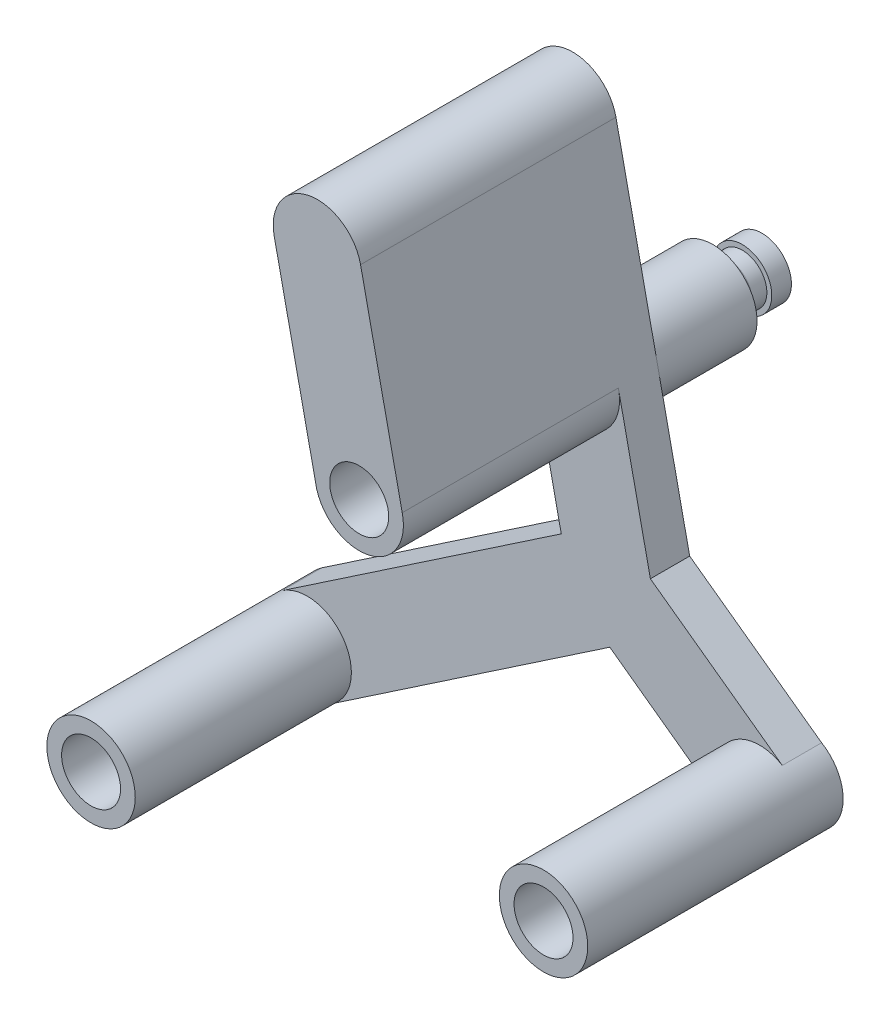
ISO-10303-21;
HEADER;
FILE_DESCRIPTION(('STEP AP214'),'2;1');
FILE_NAME('part.step','',(''),(''),'','','');
FILE_SCHEMA(('AUTOMOTIVE_DESIGN { 1 0 10303 214 1 1 1 1 }'));
ENDSEC;
DATA;
#1=APPLICATION_CONTEXT('core data for automotive mechanical design processes');
#2=APPLICATION_PROTOCOL_DEFINITION('international standard','automotive_design',2000,#1);
#3=PRODUCT_CONTEXT('',#1,'mechanical');
#4=PRODUCT('Part','Part','',(#3));
#5=PRODUCT_RELATED_PRODUCT_CATEGORY('part','',(#4));
#6=PRODUCT_DEFINITION_FORMATION('','',#4);
#7=PRODUCT_DEFINITION_CONTEXT('part definition',#1,'design');
#8=PRODUCT_DEFINITION('design','',#6,#7);
#9=PRODUCT_DEFINITION_SHAPE('','',#8);
#10=(LENGTH_UNIT() NAMED_UNIT(*) SI_UNIT(.MILLI.,.METRE.));
#11=(NAMED_UNIT(*) PLANE_ANGLE_UNIT() SI_UNIT($,.RADIAN.));
#12=(NAMED_UNIT(*) SI_UNIT($,.STERADIAN.) SOLID_ANGLE_UNIT());
#13=UNCERTAINTY_MEASURE_WITH_UNIT(LENGTH_MEASURE(1.E-05),#10,'distance_accuracy_value','');
#14=(GEOMETRIC_REPRESENTATION_CONTEXT(3) GLOBAL_UNCERTAINTY_ASSIGNED_CONTEXT((#13)) GLOBAL_UNIT_ASSIGNED_CONTEXT((#10,
#11,#12)) REPRESENTATION_CONTEXT('',''));
#15=CARTESIAN_POINT('',(0.,0.,0.));
#16=DIRECTION('',(0.,0.,1.));
#17=DIRECTION('',(1.,0.,0.));
#18=AXIS2_PLACEMENT_3D('',#15,#16,#17);
#19=CARTESIAN_POINT('',(0.,0.,-4.));
#20=DIRECTION('',(0.,0.,1.));
#21=DIRECTION('',(1.,0.,0.));
#22=AXIS2_PLACEMENT_3D('',#19,#20,#21);
#23=PLANE('',#22);
#24=DIRECTION('',(0.209958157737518,-0.977710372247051,0.));
#25=VECTOR('',#24,1.);
#26=CARTESIAN_POINT('',(4.39865793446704,0.944588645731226,-4.));
#27=LINE('',#26,#25);
#28=CARTESIAN_POINT('',(-3.46138157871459,37.5463679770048,-4.));
#29=VERTEX_POINT('',#28);
#30=CARTESIAN_POINT('',(0.80017246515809,17.7016254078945,-4.));
#31=VERTEX_POINT('',#30);
#32=EDGE_CURVE('E318',#29,#31,#27,.T.);
#33=ORIENTED_EDGE('',*,*,#32,.T.);
#34=CARTESIAN_POINT('',(-3.59848546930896,16.7570367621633,-4.));
#35=DIRECTION('',(0.,0.,-1.));
#36=DIRECTION('',(-1.,0.,0.));
#37=AXIS2_PLACEMENT_3D('',#34,#35,#36);
#38=CIRCLE('',#37,4.49893757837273);
#39=CARTESIAN_POINT('',(-8.04749548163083,16.0886437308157,-4.));
#40=VERTEX_POINT('',#39);
#41=EDGE_CURVE('E48',#40,#31,#38,.T.);
#42=ORIENTED_EDGE('',*,*,#41,.F.);
#43=DIRECTION('',(-0.209958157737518,0.977710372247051,0.));
#44=VECTOR('',#43,1.);
#45=CARTESIAN_POINT('',(-4.39009341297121,-0.942749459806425,-4.));
#46=LINE('',#45,#44);
#47=CARTESIAN_POINT('',(-12.2501329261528,35.6590298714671,-4.));
#48=VERTEX_POINT('',#47);
#49=EDGE_CURVE('E324',#40,#48,#46,.T.);
#50=ORIENTED_EDGE('',*,*,#49,.T.);
#51=CARTESIAN_POINT('',(-7.85575725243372,36.6026989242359,-4.));
#52=DIRECTION('',(0.,0.,-1.));
#53=DIRECTION('',(1.,0.,0.));
#54=AXIS2_PLACEMENT_3D('',#51,#52,#53);
#55=CIRCLE('',#54,4.49455769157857);
#56=EDGE_CURVE('E154',#48,#29,#55,.T.);
#57=ORIENTED_EDGE('',*,*,#56,.T.);
#58=EDGE_LOOP('',(#33,#42,#50,#57));
#59=FACE_BOUND('',#58,.T.);
#60=ADVANCED_FACE('F33',(#59),#23,.F.);
#61=CARTESIAN_POINT('',(0.,0.,0.));
#62=DIRECTION('',(0.,0.,1.));
#63=DIRECTION('',(1.,0.,0.));
#64=AXIS2_PLACEMENT_3D('',#61,#62,#63);
#65=PLANE('',#64);
#66=DIRECTION('',(0.809551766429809,-0.587048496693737,0.));
#67=VECTOR('',#66,1.);
#68=CARTESIAN_POINT('',(-2.64171823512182,-3.64298294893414,0.));
#69=LINE('',#68,#67);
#70=CARTESIAN_POINT('',(-0.0904885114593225,-5.49301359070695,0.));
#71=VERTEX_POINT('',#70);
#72=CARTESIAN_POINT('',(12.521976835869,-14.6389745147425,0.));
#73=VERTEX_POINT('',#72);
#74=EDGE_CURVE('E236',#71,#73,#69,.T.);
#75=ORIENTED_EDGE('',*,*,#74,.T.);
#76=CARTESIAN_POINT('',(15.1636950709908,-10.9959915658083,0.));
#77=DIRECTION('',(0.,0.,1.));
#78=DIRECTION('',(1.,0.,0.));
#79=AXIS2_PLACEMENT_3D('',#76,#77,#78);
#80=CIRCLE('',#79,4.5);
#81=CARTESIAN_POINT('',(17.4737197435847,-7.13415443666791,0.));
#82=VERTEX_POINT('',#81);
#83=EDGE_CURVE('E182',#82,#73,#80,.T.);
#84=ORIENTED_EDGE('',*,*,#83,.F.);
#85=DIRECTION('',(0.809551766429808,-0.587048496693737,0.));
#86=VECTOR('',#85,1.);
#87=CARTESIAN_POINT('',(2.63141763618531,3.62877821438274,0.));
#88=LINE('',#87,#86);
#89=CARTESIAN_POINT('',(4.04188395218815,2.60597502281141,0.));
#90=VERTEX_POINT('',#89);
#91=EDGE_CURVE('E352',#90,#82,#88,.T.);
#92=ORIENTED_EDGE('',*,*,#91,.F.);
#93=DIRECTION('',(0.209958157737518,-0.977710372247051,0.));
#94=VECTOR('',#93,1.);
#95=CARTESIAN_POINT('',(4.39865793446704,0.944588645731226,0.));
#96=LINE('',#95,#94);
#97=CARTESIAN_POINT('',(0.820701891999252,17.6060262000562,0.));
#98=VERTEX_POINT('',#97);
#99=EDGE_CURVE('E248',#98,#90,#96,.T.);
#100=ORIENTED_EDGE('',*,*,#99,.F.);
#101=CARTESIAN_POINT('',(-3.59848546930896,16.7570367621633,0.));
#102=DIRECTION('',(0.,0.,1.));
#103=DIRECTION('',(1.,0.,0.));
#104=AXIS2_PLACEMENT_3D('',#101,#102,#103);
#105=CIRCLE('',#104,4.5);
#106=CARTESIAN_POINT('',(-7.92618799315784,15.5237521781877,0.));
#107=VERTEX_POINT('',#106);
#108=EDGE_CURVE('E347',#107,#98,#105,.T.);
#109=ORIENTED_EDGE('',*,*,#108,.F.);
#110=DIRECTION('',(-0.209958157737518,0.977710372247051,0.));
#111=VECTOR('',#110,1.);
#112=CARTESIAN_POINT('',(-4.39009341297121,-0.942749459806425,0.));
#113=LINE('',#112,#111);
#114=CARTESIAN_POINT('',(-5.02892290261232,2.03208240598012,0.));
#115=VERTEX_POINT('',#114);
#116=EDGE_CURVE('E349',#115,#107,#113,.T.);
#117=ORIENTED_EDGE('',*,*,#116,.F.);
#118=DIRECTION('',(0.828448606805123,0.560065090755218,0.));
#119=VECTOR('',#118,1.);
#120=CARTESIAN_POINT('',(-2.52029290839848,3.72801873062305,0.));
#121=LINE('',#120,#119);
#122=CARTESIAN_POINT('',(-33.4165334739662,-17.1591016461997,0.));
#123=VERTEX_POINT('',#122);
#124=EDGE_CURVE('E216',#123,#115,#121,.T.);
#125=ORIENTED_EDGE('',*,*,#124,.F.);
#126=CARTESIAN_POINT('',(-30.8962405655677,-20.8871203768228,0.));
#127=DIRECTION('',(0.,0.,1.));
#128=DIRECTION('',(1.,0.,0.));
#129=AXIS2_PLACEMENT_3D('',#126,#127,#128);
#130=CIRCLE('',#129,4.5);
#131=CARTESIAN_POINT('',(-28.3759476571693,-24.6151391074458,0.));
#132=VERTEX_POINT('',#131);
#133=EDGE_CURVE('E203',#132,#123,#130,.T.);
#134=ORIENTED_EDGE('',*,*,#133,.F.);
#135=DIRECTION('',(0.828448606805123,0.560065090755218,0.));
#136=VECTOR('',#135,1.);
#137=CARTESIAN_POINT('',(2.52029290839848,-3.72801873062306,0.));
#138=LINE('',#137,#136);
#139=EDGE_CURVE('E219',#132,#71,#138,.T.);
#140=ORIENTED_EDGE('',*,*,#139,.T.);
#141=EDGE_LOOP('',(#75,#84,#92,#100,#109,#117,#125,#134,#140));
#142=FACE_BOUND('',#141,.T.);
#143=ADVANCED_FACE('F289',(#142),#65,.T.);
#144=CARTESIAN_POINT('',(-30.8962405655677,-20.8871203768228,22.));
#145=DIRECTION('',(0.,0.,-1.));
#146=DIRECTION('',(-1.,0.,0.));
#147=AXIS2_PLACEMENT_3D('',#144,#145,#146);
#148=CYLINDRICAL_SURFACE('',#147,4.5);
#149=CARTESIAN_POINT('',(-30.8962405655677,-20.8871203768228,22.));
#150=DIRECTION('',(0.,0.,1.));
#151=DIRECTION('',(1.,0.,0.));
#152=AXIS2_PLACEMENT_3D('',#149,#150,#151);
#153=CIRCLE('',#152,4.5);
#154=CARTESIAN_POINT('',(-26.3962405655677,-20.8871203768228,22.));
#155=VERTEX_POINT('',#154);
#156=EDGE_CURVE('E199',#155,#155,#153,.T.);
#157=ORIENTED_EDGE('',*,*,#156,.F.);
#158=EDGE_LOOP('',(#157));
#159=FACE_BOUND('',#158,.T.);
#160=ORIENTED_EDGE('',*,*,#133,.T.);
#161=DIRECTION('',(0.,0.,1.));
#162=VECTOR('',#161,1.);
#163=CARTESIAN_POINT('',(-33.4165334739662,-17.1591016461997,-4.));
#164=LINE('',#163,#162);
#165=CARTESIAN_POINT('',(-33.4165334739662,-17.1591016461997,-4.));
#166=VERTEX_POINT('',#165);
#167=EDGE_CURVE('E223',#166,#123,#164,.T.);
#168=ORIENTED_EDGE('',*,*,#167,.F.);
#169=CARTESIAN_POINT('',(-30.8962405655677,-20.8871203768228,-4.));
#170=DIRECTION('',(0.,0.,1.));
#171=DIRECTION('',(1.,0.,0.));
#172=AXIS2_PLACEMENT_3D('',#169,#170,#171);
#173=CIRCLE('',#172,4.5);
#174=CARTESIAN_POINT('',(-28.3759476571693,-24.6151391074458,-4.));
#175=VERTEX_POINT('',#174);
#176=EDGE_CURVE('E374',#166,#175,#173,.T.);
#177=ORIENTED_EDGE('',*,*,#176,.T.);
#178=DIRECTION('',(0.,0.,1.));
#179=VECTOR('',#178,1.);
#180=CARTESIAN_POINT('',(-28.3759476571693,-24.6151391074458,-4.));
#181=LINE('',#180,#179);
#182=EDGE_CURVE('E226',#175,#132,#181,.T.);
#183=ORIENTED_EDGE('',*,*,#182,.T.);
#184=EDGE_LOOP('',(#160,#168,#177,#183));
#185=FACE_BOUND('',#184,.T.);
#186=ADVANCED_FACE('F286',(#159,#185),#148,.T.);
#187=CARTESIAN_POINT('',(-30.8962405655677,-20.8871203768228,22.));
#188=DIRECTION('',(0.,0.,1.));
#189=DIRECTION('',(1.,0.,0.));
#190=AXIS2_PLACEMENT_3D('',#187,#188,#189);
#191=PLANE('',#190);
#192=CARTESIAN_POINT('',(-30.8962405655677,-20.8871203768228,22.));
#193=DIRECTION('',(0.,0.,1.));
#194=DIRECTION('',(1.,0.,0.));
#195=AXIS2_PLACEMENT_3D('',#192,#193,#194);
#196=CIRCLE('',#195,3.);
#197=CARTESIAN_POINT('',(-27.8962405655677,-20.8871203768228,22.));
#198=VERTEX_POINT('',#197);
#199=EDGE_CURVE('E429',#198,#198,#196,.T.);
#200=ORIENTED_EDGE('',*,*,#199,.F.);
#201=EDGE_LOOP('',(#200));
#202=FACE_BOUND('',#201,.T.);
#203=ORIENTED_EDGE('',*,*,#156,.T.);
#204=EDGE_LOOP('',(#203));
#205=FACE_BOUND('',#204,.T.);
#206=ADVANCED_FACE('F283',(#202,#205),#191,.T.);
#207=CARTESIAN_POINT('',(-2.52029290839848,3.72801873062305,-4.));
#208=DIRECTION('',(0.560065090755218,-0.828448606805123,0.));
#209=DIRECTION('',(0.828448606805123,0.560065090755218,0.));
#210=AXIS2_PLACEMENT_3D('',#207,#208,#209);
#211=PLANE('',#210);
#212=ORIENTED_EDGE('',*,*,#124,.T.);
#213=DIRECTION('',(0.,0.,1.));
#214=VECTOR('',#213,1.);
#215=CARTESIAN_POINT('',(-5.02892290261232,2.03208240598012,-4.));
#216=LINE('',#215,#214);
#217=CARTESIAN_POINT('',(-5.02892290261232,2.03208240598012,-4.));
#218=VERTEX_POINT('',#217);
#219=EDGE_CURVE('E208',#218,#115,#216,.T.);
#220=ORIENTED_EDGE('',*,*,#219,.F.);
#221=DIRECTION('',(0.828448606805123,0.560065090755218,0.));
#222=VECTOR('',#221,1.);
#223=CARTESIAN_POINT('',(-2.52029290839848,3.72801873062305,-4.));
#224=LINE('',#223,#222);
#225=EDGE_CURVE('E350',#166,#218,#224,.T.);
#226=ORIENTED_EDGE('',*,*,#225,.F.);
#227=ORIENTED_EDGE('',*,*,#167,.T.);
#228=EDGE_LOOP('',(#212,#220,#226,#227));
#229=FACE_BOUND('',#228,.T.);
#230=ADVANCED_FACE('F280',(#229),#211,.F.);
#231=CARTESIAN_POINT('',(-4.39009341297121,-0.942749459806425,-4.));
#232=DIRECTION('',(0.977710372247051,0.209958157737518,0.));
#233=DIRECTION('',(-0.209958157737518,0.977710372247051,0.));
#234=AXIS2_PLACEMENT_3D('',#231,#232,#233);
#235=PLANE('',#234);
#236=ORIENTED_EDGE('',*,*,#116,.T.);
#237=DIRECTION('',(0.209958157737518,-0.977710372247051,0.));
#238=VECTOR('',#237,1.);
#239=CARTESIAN_POINT('',(-4.39009341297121,-0.942749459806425,0.));
#240=LINE('',#239,#238);
#241=CARTESIAN_POINT('',(-8.05096977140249,16.1048224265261,0.));
#242=VERTEX_POINT('',#241);
#243=EDGE_CURVE('E220',#242,#107,#240,.T.);
#244=ORIENTED_EDGE('',*,*,#243,.F.);
#245=DIRECTION('',(0.,0.,-1.));
#246=VECTOR('',#245,1.);
#247=CARTESIAN_POINT('',(-8.05096977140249,16.1048224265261,50.2314994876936));
#248=LINE('',#247,#246);
#249=CARTESIAN_POINT('',(-8.05096977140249,16.1048224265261,22.));
#250=VERTEX_POINT('',#249);
#251=EDGE_CURVE('E160',#250,#242,#248,.T.);
#252=ORIENTED_EDGE('',*,*,#251,.F.);
#253=DIRECTION('',(-0.209958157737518,0.977710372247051,0.));
#254=VECTOR('',#253,1.);
#255=CARTESIAN_POINT('',(-8.05096977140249,16.1048224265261,22.));
#256=LINE('',#255,#254);
#257=CARTESIAN_POINT('',(-12.2501329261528,35.6590298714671,22.));
#258=VERTEX_POINT('',#257);
#259=EDGE_CURVE('E141',#250,#258,#256,.T.);
#260=ORIENTED_EDGE('',*,*,#259,.T.);
#261=DIRECTION('',(0.,0.,-1.));
#262=VECTOR('',#261,1.);
#263=CARTESIAN_POINT('',(-12.2501329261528,35.6590298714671,50.2314994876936));
#264=LINE('',#263,#262);
#265=EDGE_CURVE('E148',#258,#48,#264,.T.);
#266=ORIENTED_EDGE('',*,*,#265,.T.);
#267=ORIENTED_EDGE('',*,*,#49,.F.);
#268=DIRECTION('',(0.,0.,1.));
#269=VECTOR('',#268,1.);
#270=CARTESIAN_POINT('',(-8.04749548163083,16.0886437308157,-14.));
#271=LINE('',#270,#269);
#272=CARTESIAN_POINT('',(-8.04749548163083,16.0886437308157,-14.));
#273=VERTEX_POINT('',#272);
#274=EDGE_CURVE('E179',#273,#40,#271,.T.);
#275=ORIENTED_EDGE('',*,*,#274,.F.);
#276=DIRECTION('',(-0.209958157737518,0.977710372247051,0.));
#277=VECTOR('',#276,1.);
#278=CARTESIAN_POINT('',(-4.39009341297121,-0.942749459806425,-14.));
#279=LINE('',#278,#277);
#280=CARTESIAN_POINT('',(-7.92966228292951,15.539930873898,-14.));
#281=VERTEX_POINT('',#280);
#282=EDGE_CURVE('E177',#281,#273,#279,.T.);
#283=ORIENTED_EDGE('',*,*,#282,.F.);
#284=DIRECTION('',(0.,0.,1.));
#285=VECTOR('',#284,1.);
#286=CARTESIAN_POINT('',(-7.92966228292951,15.539930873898,-14.));
#287=LINE('',#286,#285);
#288=CARTESIAN_POINT('',(-7.92966228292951,15.539930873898,-4.));
#289=VERTEX_POINT('',#288);
#290=EDGE_CURVE('E194',#281,#289,#287,.T.);
#291=ORIENTED_EDGE('',*,*,#290,.T.);
#292=EDGE_CURVE('E227',#218,#289,#46,.T.);
#293=ORIENTED_EDGE('',*,*,#292,.F.);
#294=ORIENTED_EDGE('',*,*,#219,.T.);
#295=EDGE_LOOP('',(#236,#244,#252,#260,#266,#267,#275,#283,#291,#293,#294));
#296=FACE_BOUND('',#295,.T.);
#297=ADVANCED_FACE('F158',(#296),#235,.F.);
#298=CARTESIAN_POINT('',(-3.59848546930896,16.7570367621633,-4.));
#299=DIRECTION('',(0.,0.,1.));
#300=DIRECTION('',(1.,0.,0.));
#301=AXIS2_PLACEMENT_3D('',#298,#299,#300);
#302=CYLINDRICAL_SURFACE('',#301,4.5);
#303=DIRECTION('',(0.,0.,-1.));
#304=VECTOR('',#303,1.);
#305=CARTESIAN_POINT('',(0.779643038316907,17.7972246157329,50.2314994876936));
#306=LINE('',#305,#304);
#307=CARTESIAN_POINT('',(0.779643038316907,17.7972246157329,22.));
#308=VERTEX_POINT('',#307);
#309=CARTESIAN_POINT('',(0.779643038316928,17.7972246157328,0.));
#310=VERTEX_POINT('',#309);
#311=EDGE_CURVE('E167',#308,#310,#306,.T.);
#312=ORIENTED_EDGE('',*,*,#311,.F.);
#313=CARTESIAN_POINT('',(-3.59848546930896,16.7570367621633,22.));
#314=DIRECTION('',(0.,0.,1.));
#315=DIRECTION('',(1.,0.,0.));
#316=AXIS2_PLACEMENT_3D('',#313,#314,#315);
#317=CIRCLE('',#316,4.5);
#318=EDGE_CURVE('E384',#250,#308,#317,.T.);
#319=ORIENTED_EDGE('',*,*,#318,.F.);
#320=ORIENTED_EDGE('',*,*,#251,.T.);
#321=EDGE_CURVE('E391',#242,#107,#105,.T.);
#322=ORIENTED_EDGE('',*,*,#321,.T.);
#323=ORIENTED_EDGE('',*,*,#108,.T.);
#324=CARTESIAN_POINT('',(0.779643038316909,17.7972246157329,0.));
#325=DIRECTION('',(0.209958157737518,-0.977710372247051,0.));
#326=VECTOR('',#325,1.);
#327=LINE('',#324,#326);
#328=EDGE_CURVE('E243',#310,#98,#327,.T.);
#329=ORIENTED_EDGE('',*,*,#328,.F.);
#330=EDGE_LOOP('',(#312,#319,#320,#322,#323,#329));
#331=FACE_BOUND('',#330,.T.);
#332=ADVANCED_FACE('F261',(#331),#302,.T.);
#333=CARTESIAN_POINT('',(4.39865793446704,0.944588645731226,-4.));
#334=DIRECTION('',(-0.977710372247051,-0.209958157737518,0.));
#335=DIRECTION('',(0.209958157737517,-0.977710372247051,0.));
#336=AXIS2_PLACEMENT_3D('',#333,#334,#335);
#337=PLANE('',#336);
#338=ORIENTED_EDGE('',*,*,#328,.T.);
#339=ORIENTED_EDGE('',*,*,#99,.T.);
#340=DIRECTION('',(0.,0.,1.));
#341=VECTOR('',#340,1.);
#342=CARTESIAN_POINT('',(4.04188395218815,2.60597502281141,-4.));
#343=LINE('',#342,#341);
#344=CARTESIAN_POINT('',(4.04188395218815,2.60597502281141,-4.));
#345=VERTEX_POINT('',#344);
#346=EDGE_CURVE('E320',#345,#90,#343,.T.);
#347=ORIENTED_EDGE('',*,*,#346,.F.);
#348=EDGE_CURVE('E315',#31,#345,#27,.T.);
#349=ORIENTED_EDGE('',*,*,#348,.F.);
#350=ORIENTED_EDGE('',*,*,#32,.F.);
#351=DIRECTION('',(0.,0.,-1.));
#352=VECTOR('',#351,1.);
#353=CARTESIAN_POINT('',(-3.46138157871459,37.5463679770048,50.2314994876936));
#354=LINE('',#353,#352);
#355=CARTESIAN_POINT('',(-3.46138157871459,37.5463679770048,22.));
#356=VERTEX_POINT('',#355);
#357=EDGE_CURVE('E147',#356,#29,#354,.T.);
#358=ORIENTED_EDGE('',*,*,#357,.F.);
#359=DIRECTION('',(0.209958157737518,-0.977710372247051,0.));
#360=VECTOR('',#359,1.);
#361=CARTESIAN_POINT('',(-3.46138157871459,37.5463679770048,22.));
#362=LINE('',#361,#360);
#363=EDGE_CURVE('E143',#356,#308,#362,.T.);
#364=ORIENTED_EDGE('',*,*,#363,.T.);
#365=ORIENTED_EDGE('',*,*,#311,.T.);
#366=EDGE_LOOP('',(#338,#339,#347,#349,#350,#358,#364,#365));
#367=FACE_BOUND('',#366,.T.);
#368=ADVANCED_FACE('F250',(#367),#337,.F.);
#369=CARTESIAN_POINT('',(2.63141763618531,3.62877821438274,-4.));
#370=DIRECTION('',(-0.587048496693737,-0.809551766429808,0.));
#371=DIRECTION('',(0.809551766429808,-0.587048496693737,0.));
#372=AXIS2_PLACEMENT_3D('',#369,#370,#371);
#373=PLANE('',#372);
#374=ORIENTED_EDGE('',*,*,#91,.T.);
#375=DIRECTION('',(0.,0.,1.));
#376=VECTOR('',#375,1.);
#377=CARTESIAN_POINT('',(17.4737197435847,-7.13415443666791,-4.));
#378=LINE('',#377,#376);
#379=CARTESIAN_POINT('',(17.4737197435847,-7.13415443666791,-4.));
#380=VERTEX_POINT('',#379);
#381=EDGE_CURVE('E361',#380,#82,#378,.T.);
#382=ORIENTED_EDGE('',*,*,#381,.F.);
#383=DIRECTION('',(0.809551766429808,-0.587048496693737,0.));
#384=VECTOR('',#383,1.);
#385=CARTESIAN_POINT('',(2.63141763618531,3.62877821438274,-4.));
#386=LINE('',#385,#384);
#387=EDGE_CURVE('E322',#345,#380,#386,.T.);
#388=ORIENTED_EDGE('',*,*,#387,.F.);
#389=ORIENTED_EDGE('',*,*,#346,.T.);
#390=EDGE_LOOP('',(#374,#382,#388,#389));
#391=FACE_BOUND('',#390,.T.);
#392=ADVANCED_FACE('F260',(#391),#373,.F.);
#393=CARTESIAN_POINT('',(15.1636950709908,-10.9959915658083,-4.));
#394=DIRECTION('',(0.,0.,1.));
#395=DIRECTION('',(1.,0.,0.));
#396=AXIS2_PLACEMENT_3D('',#393,#394,#395);
#397=CYLINDRICAL_SURFACE('',#396,4.5);
#398=ORIENTED_EDGE('',*,*,#381,.T.);
#399=ORIENTED_EDGE('',*,*,#83,.T.);
#400=DIRECTION('',(0.,0.,1.));
#401=VECTOR('',#400,1.);
#402=CARTESIAN_POINT('',(12.521976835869,-14.6389745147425,-4.));
#403=LINE('',#402,#401);
#404=CARTESIAN_POINT('',(12.521976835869,-14.6389745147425,-4.));
#405=VERTEX_POINT('',#404);
#406=EDGE_CURVE('E362',#405,#73,#403,.T.);
#407=ORIENTED_EDGE('',*,*,#406,.F.);
#408=CARTESIAN_POINT('',(15.1636950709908,-10.9959915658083,-4.));
#409=DIRECTION('',(0.,0.,1.));
#410=DIRECTION('',(1.,0.,0.));
#411=AXIS2_PLACEMENT_3D('',#408,#409,#410);
#412=CIRCLE('',#411,4.5);
#413=EDGE_CURVE('E378',#405,#380,#412,.T.);
#414=ORIENTED_EDGE('',*,*,#413,.T.);
#415=EDGE_LOOP('',(#398,#399,#407,#414));
#416=FACE_BOUND('',#415,.T.);
#417=CARTESIAN_POINT('',(15.1636950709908,-10.9959915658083,22.));
#418=DIRECTION('',(0.,0.,1.));
#419=DIRECTION('',(1.,0.,0.));
#420=AXIS2_PLACEMENT_3D('',#417,#418,#419);
#421=CIRCLE('',#420,4.5);
#422=CARTESIAN_POINT('',(19.6636950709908,-10.9959915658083,22.));
#423=VERTEX_POINT('',#422);
#424=EDGE_CURVE('E385',#423,#423,#421,.T.);
#425=ORIENTED_EDGE('',*,*,#424,.F.);
#426=EDGE_LOOP('',(#425));
#427=FACE_BOUND('',#426,.T.);
#428=ADVANCED_FACE('F266',(#416,#427),#397,.T.);
#429=CARTESIAN_POINT('',(-2.64171823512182,-3.64298294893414,-4.));
#430=DIRECTION('',(-0.587048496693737,-0.809551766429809,0.));
#431=DIRECTION('',(0.809551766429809,-0.587048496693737,0.));
#432=AXIS2_PLACEMENT_3D('',#429,#430,#431);
#433=PLANE('',#432);
#434=ORIENTED_EDGE('',*,*,#74,.F.);
#435=DIRECTION('',(0.,0.,1.));
#436=VECTOR('',#435,1.);
#437=CARTESIAN_POINT('',(-0.0904885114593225,-5.49301359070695,-4.));
#438=LINE('',#437,#436);
#439=CARTESIAN_POINT('',(-0.0904885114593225,-5.49301359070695,-4.));
#440=VERTEX_POINT('',#439);
#441=EDGE_CURVE('E212',#440,#71,#438,.T.);
#442=ORIENTED_EDGE('',*,*,#441,.F.);
#443=DIRECTION('',(0.809551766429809,-0.587048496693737,0.));
#444=VECTOR('',#443,1.);
#445=CARTESIAN_POINT('',(-2.64171823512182,-3.64298294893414,-4.));
#446=LINE('',#445,#444);
#447=EDGE_CURVE('E376',#440,#405,#446,.T.);
#448=ORIENTED_EDGE('',*,*,#447,.T.);
#449=ORIENTED_EDGE('',*,*,#406,.T.);
#450=EDGE_LOOP('',(#434,#442,#448,#449));
#451=FACE_BOUND('',#450,.T.);
#452=ADVANCED_FACE('F270',(#451),#433,.T.);
#453=CARTESIAN_POINT('',(2.52029290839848,-3.72801873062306,-4.));
#454=DIRECTION('',(0.560065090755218,-0.828448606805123,0.));
#455=DIRECTION('',(0.828448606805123,0.560065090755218,0.));
#456=AXIS2_PLACEMENT_3D('',#453,#454,#455);
#457=PLANE('',#456);
#458=ORIENTED_EDGE('',*,*,#139,.F.);
#459=ORIENTED_EDGE('',*,*,#182,.F.);
#460=DIRECTION('',(0.828448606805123,0.560065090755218,0.));
#461=VECTOR('',#460,1.);
#462=CARTESIAN_POINT('',(2.52029290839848,-3.72801873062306,-4.));
#463=LINE('',#462,#461);
#464=EDGE_CURVE('E368',#175,#440,#463,.T.);
#465=ORIENTED_EDGE('',*,*,#464,.T.);
#466=ORIENTED_EDGE('',*,*,#441,.T.);
#467=EDGE_LOOP('',(#458,#459,#465,#466));
#468=FACE_BOUND('',#467,.T.);
#469=ADVANCED_FACE('F274',(#468),#457,.T.);
#470=EDGE_CURVE('E186',#31,#289,#38,.T.);
#471=ORIENTED_EDGE('',*,*,#470,.F.);
#472=ORIENTED_EDGE('',*,*,#348,.T.);
#473=ORIENTED_EDGE('',*,*,#387,.T.);
#474=ORIENTED_EDGE('',*,*,#413,.F.);
#475=ORIENTED_EDGE('',*,*,#447,.F.);
#476=ORIENTED_EDGE('',*,*,#464,.F.);
#477=ORIENTED_EDGE('',*,*,#176,.F.);
#478=ORIENTED_EDGE('',*,*,#225,.T.);
#479=ORIENTED_EDGE('',*,*,#292,.T.);
#480=EDGE_LOOP('',(#471,#472,#473,#474,#475,#476,#477,#478,#479));
#481=FACE_BOUND('',#480,.T.);
#482=ADVANCED_FACE('F278',(#481),#23,.F.);
#483=CARTESIAN_POINT('',(-3.59848546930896,16.7570367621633,0.));
#484=DIRECTION('',(0.,0.,1.));
#485=DIRECTION('',(1.,0.,0.));
#486=AXIS2_PLACEMENT_3D('',#483,#484,#485);
#487=PLANE('',#486);
#488=ORIENTED_EDGE('',*,*,#321,.F.);
#489=ORIENTED_EDGE('',*,*,#243,.T.);
#490=EDGE_LOOP('',(#488,#489));
#491=FACE_BOUND('',#490,.T.);
#492=ADVANCED_FACE('F306',(#491),#487,.F.);
#493=CARTESIAN_POINT('',(-3.59848546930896,16.7570367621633,22.));
#494=DIRECTION('',(0.,0.,1.));
#495=DIRECTION('',(1.,0.,0.));
#496=AXIS2_PLACEMENT_3D('',#493,#494,#495);
#497=PLANE('',#496);
#498=CARTESIAN_POINT('',(-3.59848546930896,16.7570367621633,22.));
#499=DIRECTION('',(0.,0.,1.));
#500=DIRECTION('',(1.,0.,0.));
#501=AXIS2_PLACEMENT_3D('',#498,#499,#500);
#502=CIRCLE('',#501,3.);
#503=CARTESIAN_POINT('',(-0.598485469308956,16.7570367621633,22.));
#504=VERTEX_POINT('',#503);
#505=EDGE_CURVE('E423',#504,#504,#502,.T.);
#506=ORIENTED_EDGE('',*,*,#505,.F.);
#507=EDGE_LOOP('',(#506));
#508=FACE_BOUND('',#507,.T.);
#509=ORIENTED_EDGE('',*,*,#318,.T.);
#510=ORIENTED_EDGE('',*,*,#363,.F.);
#511=CARTESIAN_POINT('',(-7.85575725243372,36.6026989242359,22.));
#512=DIRECTION('',(0.,0.,1.));
#513=DIRECTION('',(1.,0.,0.));
#514=AXIS2_PLACEMENT_3D('',#511,#512,#513);
#515=CIRCLE('',#514,4.49455769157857);
#516=EDGE_CURVE('E136',#258,#356,#515,.F.);
#517=ORIENTED_EDGE('',*,*,#516,.F.);
#518=ORIENTED_EDGE('',*,*,#259,.F.);
#519=EDGE_LOOP('',(#509,#510,#517,#518));
#520=FACE_BOUND('',#519,.T.);
#521=ADVANCED_FACE('F139',(#508,#520),#497,.T.);
#522=CARTESIAN_POINT('',(15.1636950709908,-10.9959915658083,22.));
#523=DIRECTION('',(0.,0.,1.));
#524=DIRECTION('',(1.,0.,0.));
#525=AXIS2_PLACEMENT_3D('',#522,#523,#524);
#526=PLANE('',#525);
#527=CARTESIAN_POINT('',(15.1636950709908,-10.9959915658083,22.));
#528=DIRECTION('',(0.,0.,1.));
#529=DIRECTION('',(1.,0.,0.));
#530=AXIS2_PLACEMENT_3D('',#527,#528,#529);
#531=CIRCLE('',#530,3.);
#532=CARTESIAN_POINT('',(18.1636950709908,-10.9959915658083,22.));
#533=VERTEX_POINT('',#532);
#534=EDGE_CURVE('E432',#533,#533,#531,.T.);
#535=ORIENTED_EDGE('',*,*,#534,.F.);
#536=EDGE_LOOP('',(#535));
#537=FACE_BOUND('',#536,.T.);
#538=ORIENTED_EDGE('',*,*,#424,.T.);
#539=EDGE_LOOP('',(#538));
#540=FACE_BOUND('',#539,.T.);
#541=ADVANCED_FACE('F411',(#537,#540),#526,.T.);
#542=CARTESIAN_POINT('',(-3.59848546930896,16.7570367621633,-14.));
#543=DIRECTION('',(0.,0.,1.));
#544=DIRECTION('',(1.,0.,0.));
#545=AXIS2_PLACEMENT_3D('',#542,#543,#544);
#546=CYLINDRICAL_SURFACE('',#545,4.49893757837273);
#547=ORIENTED_EDGE('',*,*,#41,.T.);
#548=ORIENTED_EDGE('',*,*,#470,.T.);
#549=ORIENTED_EDGE('',*,*,#290,.F.);
#550=CARTESIAN_POINT('',(-3.59848546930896,16.7570367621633,-14.));
#551=DIRECTION('',(0.,0.,-1.));
#552=DIRECTION('',(-1.,0.,0.));
#553=AXIS2_PLACEMENT_3D('',#550,#551,#552);
#554=CIRCLE('',#553,4.49893757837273);
#555=EDGE_CURVE('E174',#273,#281,#554,.T.);
#556=ORIENTED_EDGE('',*,*,#555,.F.);
#557=ORIENTED_EDGE('',*,*,#274,.T.);
#558=EDGE_LOOP('',(#547,#548,#549,#556,#557));
#559=FACE_BOUND('',#558,.T.);
#560=ADVANCED_FACE('F399',(#559),#546,.T.);
#561=CARTESIAN_POINT('',(0.,0.,-14.));
#562=DIRECTION('',(0.,0.,-1.));
#563=DIRECTION('',(-1.,0.,0.));
#564=AXIS2_PLACEMENT_3D('',#561,#562,#563);
#565=PLANE('',#564);
#566=CARTESIAN_POINT('',(-3.59848546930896,16.7570367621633,-14.));
#567=DIRECTION('',(0.,0.,-1.));
#568=DIRECTION('',(-1.,0.,0.));
#569=AXIS2_PLACEMENT_3D('',#566,#567,#568);
#570=CIRCLE('',#569,4.);
#571=CARTESIAN_POINT('',(-7.59848546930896,16.7570367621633,-14.));
#572=VERTEX_POINT('',#571);
#573=EDGE_CURVE('E11',#572,#572,#570,.F.);
#574=ORIENTED_EDGE('',*,*,#573,.T.);
#575=EDGE_LOOP('',(#574));
#576=FACE_BOUND('',#575,.T.);
#577=ORIENTED_EDGE('',*,*,#555,.T.);
#578=ORIENTED_EDGE('',*,*,#282,.T.);
#579=EDGE_LOOP('',(#577,#578));
#580=FACE_BOUND('',#579,.T.);
#581=ADVANCED_FACE('F401',(#576,#580),#565,.T.);
#582=CARTESIAN_POINT('',(-7.85575725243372,36.6026989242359,50.2314994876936));
#583=DIRECTION('',(0.,0.,-1.));
#584=DIRECTION('',(-1.,0.,0.));
#585=AXIS2_PLACEMENT_3D('',#582,#583,#584);
#586=CYLINDRICAL_SURFACE('',#585,4.49455769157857);
#587=ORIENTED_EDGE('',*,*,#265,.F.);
#588=ORIENTED_EDGE('',*,*,#516,.T.);
#589=ORIENTED_EDGE('',*,*,#357,.T.);
#590=ORIENTED_EDGE('',*,*,#56,.F.);
#591=EDGE_LOOP('',(#587,#588,#589,#590));
#592=FACE_BOUND('',#591,.T.);
#593=ADVANCED_FACE('F152',(#592),#586,.T.);
#594=CARTESIAN_POINT('',(-30.8962405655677,-20.8871203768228,14.));
#595=DIRECTION('',(0.,0.,1.));
#596=DIRECTION('',(1.,0.,0.));
#597=AXIS2_PLACEMENT_3D('',#594,#595,#596);
#598=CYLINDRICAL_SURFACE('',#597,3.);
#599=CARTESIAN_POINT('',(-30.8962405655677,-20.8871203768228,14.));
#600=DIRECTION('',(0.,0.,1.));
#601=DIRECTION('',(1.,0.,0.));
#602=AXIS2_PLACEMENT_3D('',#599,#600,#601);
#603=CIRCLE('',#602,3.);
#604=CARTESIAN_POINT('',(-27.8962405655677,-20.8871203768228,14.));
#605=VERTEX_POINT('',#604);
#606=EDGE_CURVE('E163',#605,#605,#603,.T.);
#607=ORIENTED_EDGE('',*,*,#606,.F.);
#608=EDGE_LOOP('',(#607));
#609=FACE_BOUND('',#608,.T.);
#610=ORIENTED_EDGE('',*,*,#199,.T.);
#611=EDGE_LOOP('',(#610));
#612=FACE_BOUND('',#611,.T.);
#613=ADVANCED_FACE('F409',(#609,#612),#598,.F.);
#614=CARTESIAN_POINT('',(-30.8962405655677,-20.8871203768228,14.));
#615=DIRECTION('',(0.,0.,1.));
#616=DIRECTION('',(1.,0.,0.));
#617=AXIS2_PLACEMENT_3D('',#614,#615,#616);
#618=PLANE('',#617);
#619=ORIENTED_EDGE('',*,*,#606,.T.);
#620=EDGE_LOOP('',(#619));
#621=FACE_BOUND('',#620,.T.);
#622=ADVANCED_FACE('F441',(#621),#618,.T.);
#623=CARTESIAN_POINT('',(-3.59848546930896,16.7570367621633,14.));
#624=DIRECTION('',(0.,0.,1.));
#625=DIRECTION('',(1.,0.,0.));
#626=AXIS2_PLACEMENT_3D('',#623,#624,#625);
#627=CYLINDRICAL_SURFACE('',#626,3.);
#628=CARTESIAN_POINT('',(-3.59848546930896,16.7570367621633,14.));
#629=DIRECTION('',(0.,0.,1.));
#630=DIRECTION('',(1.,0.,0.));
#631=AXIS2_PLACEMENT_3D('',#628,#629,#630);
#632=CIRCLE('',#631,3.);
#633=CARTESIAN_POINT('',(-0.598485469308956,16.7570367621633,14.));
#634=VERTEX_POINT('',#633);
#635=EDGE_CURVE('E425',#634,#634,#632,.T.);
#636=ORIENTED_EDGE('',*,*,#635,.F.);
#637=EDGE_LOOP('',(#636));
#638=FACE_BOUND('',#637,.T.);
#639=ORIENTED_EDGE('',*,*,#505,.T.);
#640=EDGE_LOOP('',(#639));
#641=FACE_BOUND('',#640,.T.);
#642=ADVANCED_FACE('F446',(#638,#641),#627,.F.);
#643=CARTESIAN_POINT('',(-3.59848546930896,16.7570367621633,14.));
#644=DIRECTION('',(0.,0.,1.));
#645=DIRECTION('',(1.,0.,0.));
#646=AXIS2_PLACEMENT_3D('',#643,#644,#645);
#647=PLANE('',#646);
#648=ORIENTED_EDGE('',*,*,#635,.T.);
#649=EDGE_LOOP('',(#648));
#650=FACE_BOUND('',#649,.T.);
#651=ADVANCED_FACE('F453',(#650),#647,.T.);
#652=CARTESIAN_POINT('',(15.1636950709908,-10.9959915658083,14.));
#653=DIRECTION('',(0.,0.,1.));
#654=DIRECTION('',(1.,0.,0.));
#655=AXIS2_PLACEMENT_3D('',#652,#653,#654);
#656=CYLINDRICAL_SURFACE('',#655,3.);
#657=CARTESIAN_POINT('',(15.1636950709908,-10.9959915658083,14.));
#658=DIRECTION('',(0.,0.,1.));
#659=DIRECTION('',(1.,0.,0.));
#660=AXIS2_PLACEMENT_3D('',#657,#658,#659);
#661=CIRCLE('',#660,3.);
#662=CARTESIAN_POINT('',(18.1636950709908,-10.9959915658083,14.));
#663=VERTEX_POINT('',#662);
#664=EDGE_CURVE('E426',#663,#663,#661,.T.);
#665=ORIENTED_EDGE('',*,*,#664,.F.);
#666=EDGE_LOOP('',(#665));
#667=FACE_BOUND('',#666,.T.);
#668=ORIENTED_EDGE('',*,*,#534,.T.);
#669=EDGE_LOOP('',(#668));
#670=FACE_BOUND('',#669,.T.);
#671=ADVANCED_FACE('F457',(#667,#670),#656,.F.);
#672=CARTESIAN_POINT('',(15.1636950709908,-10.9959915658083,14.));
#673=DIRECTION('',(0.,0.,1.));
#674=DIRECTION('',(1.,0.,0.));
#675=AXIS2_PLACEMENT_3D('',#672,#673,#674);
#676=PLANE('',#675);
#677=ORIENTED_EDGE('',*,*,#664,.T.);
#678=EDGE_LOOP('',(#677));
#679=FACE_BOUND('',#678,.T.);
#680=ADVANCED_FACE('F461',(#679),#676,.T.);
#681=CARTESIAN_POINT('',(-3.59848546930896,16.7570367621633,-17.));
#682=DIRECTION('',(0.,0.,1.));
#683=DIRECTION('',(1.,0.,0.));
#684=AXIS2_PLACEMENT_3D('',#681,#682,#683);
#685=CYLINDRICAL_SURFACE('',#684,2.5);
#686=CARTESIAN_POINT('',(-3.59848546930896,16.7570367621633,-15.5));
#687=DIRECTION('',(0.,0.,-1.));
#688=DIRECTION('',(-1.,0.,0.));
#689=AXIS2_PLACEMENT_3D('',#686,#687,#688);
#690=CIRCLE('',#689,2.5);
#691=CARTESIAN_POINT('',(-6.09848546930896,16.7570367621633,-15.5));
#692=VERTEX_POINT('',#691);
#693=EDGE_CURVE('E41',#692,#692,#690,.T.);
#694=ORIENTED_EDGE('',*,*,#693,.T.);
#695=EDGE_LOOP('',(#694));
#696=FACE_BOUND('',#695,.T.);
#697=CARTESIAN_POINT('',(-3.59848546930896,16.7570367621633,-17.));
#698=DIRECTION('',(0.,0.,-1.));
#699=DIRECTION('',(-1.,0.,0.));
#700=AXIS2_PLACEMENT_3D('',#697,#698,#699);
#701=CIRCLE('',#700,2.5);
#702=CARTESIAN_POINT('',(-6.09848546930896,16.7570367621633,-17.));
#703=VERTEX_POINT('',#702);
#704=EDGE_CURVE('E485',#703,#703,#701,.T.);
#705=ORIENTED_EDGE('',*,*,#704,.F.);
#706=EDGE_LOOP('',(#705));
#707=FACE_BOUND('',#706,.T.);
#708=ADVANCED_FACE('F465',(#696,#707),#685,.T.);
#709=CARTESIAN_POINT('',(-3.59848546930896,16.7570367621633,-19.));
#710=DIRECTION('',(0.,0.,1.));
#711=DIRECTION('',(1.,0.,0.));
#712=AXIS2_PLACEMENT_3D('',#709,#710,#711);
#713=CYLINDRICAL_SURFACE('',#712,3.);
#714=CARTESIAN_POINT('',(-3.59848546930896,16.7570367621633,-19.));
#715=DIRECTION('',(0.,0.,-1.));
#716=DIRECTION('',(-1.,0.,0.));
#717=AXIS2_PLACEMENT_3D('',#714,#715,#716);
#718=CIRCLE('',#717,3.);
#719=CARTESIAN_POINT('',(-6.59848546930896,16.7570367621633,-19.));
#720=VERTEX_POINT('',#719);
#721=EDGE_CURVE('E484',#720,#720,#718,.T.);
#722=ORIENTED_EDGE('',*,*,#721,.F.);
#723=EDGE_LOOP('',(#722));
#724=FACE_BOUND('',#723,.T.);
#725=CARTESIAN_POINT('',(-3.59848546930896,16.7570367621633,-17.));
#726=DIRECTION('',(0.,0.,-1.));
#727=DIRECTION('',(-1.,0.,0.));
#728=AXIS2_PLACEMENT_3D('',#725,#726,#727);
#729=CIRCLE('',#728,3.);
#730=CARTESIAN_POINT('',(-6.59848546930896,16.7570367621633,-17.));
#731=VERTEX_POINT('',#730);
#732=EDGE_CURVE('E486',#731,#731,#729,.T.);
#733=ORIENTED_EDGE('',*,*,#732,.T.);
#734=EDGE_LOOP('',(#733));
#735=FACE_BOUND('',#734,.T.);
#736=ADVANCED_FACE('F469',(#724,#735),#713,.T.);
#737=CARTESIAN_POINT('',(-3.59848546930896,16.7570367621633,-19.));
#738=DIRECTION('',(0.,0.,-1.));
#739=DIRECTION('',(-1.,0.,0.));
#740=AXIS2_PLACEMENT_3D('',#737,#738,#739);
#741=PLANE('',#740);
#742=ORIENTED_EDGE('',*,*,#721,.T.);
#743=EDGE_LOOP('',(#742));
#744=FACE_BOUND('',#743,.T.);
#745=ADVANCED_FACE('F472',(#744),#741,.T.);
#746=CARTESIAN_POINT('',(-3.59848546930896,16.7570367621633,-17.));
#747=DIRECTION('',(0.,0.,-1.));
#748=DIRECTION('',(-1.,0.,0.));
#749=AXIS2_PLACEMENT_3D('',#746,#747,#748);
#750=PLANE('',#749);
#751=ORIENTED_EDGE('',*,*,#704,.T.);
#752=EDGE_LOOP('',(#751));
#753=FACE_BOUND('',#752,.T.);
#754=ORIENTED_EDGE('',*,*,#732,.F.);
#755=EDGE_LOOP('',(#754));
#756=FACE_BOUND('',#755,.T.);
#757=ADVANCED_FACE('F474',(#753,#756),#750,.F.);
#758=CARTESIAN_POINT('',(-3.59848546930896,16.7570367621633,-15.5));
#759=DIRECTION('',(0.,0.,-1.));
#760=DIRECTION('',(-1.,0.,0.));
#761=AXIS2_PLACEMENT_3D('',#758,#759,#760);
#762=TOROIDAL_SURFACE('',#761,4.,1.5);
#763=ORIENTED_EDGE('',*,*,#573,.F.);
#764=EDGE_LOOP('',(#763));
#765=FACE_BOUND('',#764,.T.);
#766=ORIENTED_EDGE('',*,*,#693,.F.);
#767=EDGE_LOOP('',(#766));
#768=FACE_BOUND('',#767,.T.);
#769=ADVANCED_FACE('F35',(#765,#768),#762,.F.);
#770=CLOSED_SHELL('',(#60,#143,#186,#206,#230,#297,#332,#368,#392,#428,#452,#469,#482,#492,#521,
#541,#560,#581,#593,#613,#622,#642,#651,#671,#680,#708,#736,#745,#757,#769));
#771=MANIFOLD_SOLID_BREP('B2',#770);
#772=ADVANCED_BREP_SHAPE_REPRESENTATION('',(#18,#771),#14);
#773=SHAPE_DEFINITION_REPRESENTATION(#9,#772);
ENDSEC;
END-ISO-10303-21;
